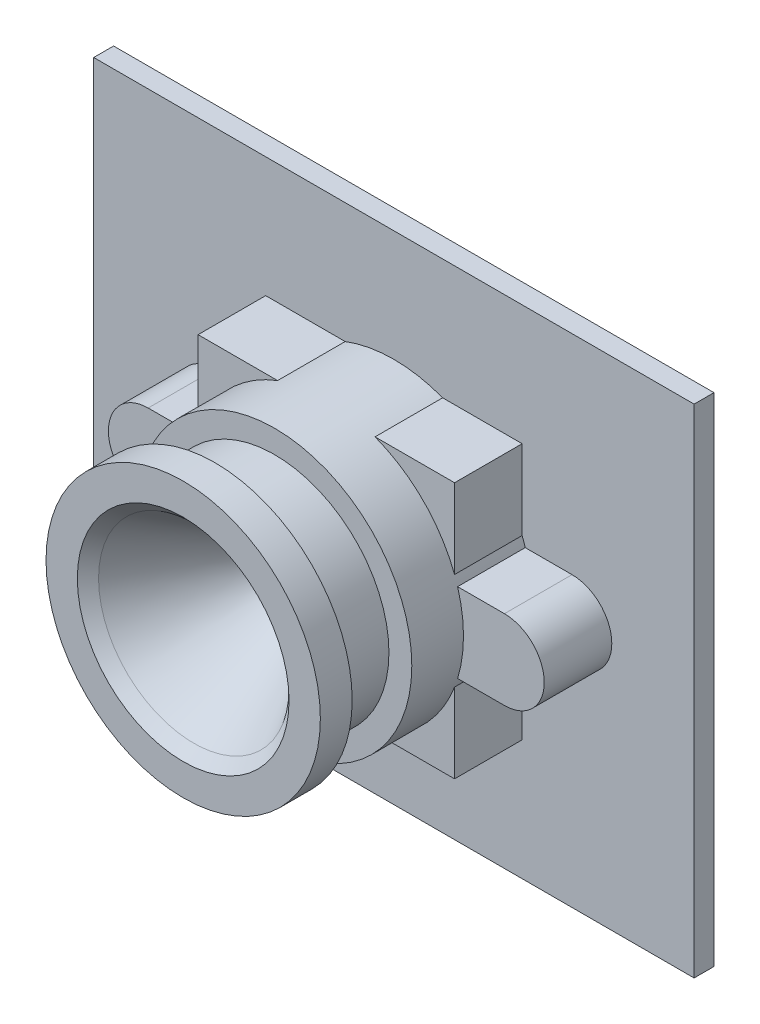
from build123d import *

# Parameters (mm, degrees)
SKETCH1_W           = 30.2
SKETCH1_H           = 25
BOSS_EXTRUDE1_DEPTH = 1
SKETCH2_W           = 12.9
SKETCH2_H           = 12.9
BOSS_EXTRUDE2_DEPTH = 3.4
SKETCH3_R           = 6.9
BOSS_EXTRUDE3_DEPTH = 6
SKETCH4_R           = 5.75
BOSS_EXTRUDE4_DEPTH = 3
SKETCH5_R           = 6.9
BOSS_EXTRUDE5_DEPTH = 1.6
SKETCH6_R           = 5.125
CUT_EXTRUDE1_DEPTH  = 5.65
CUT_EXTRUDE1_DRAFT  = -32
CHAMFER1_SIZE       = 0.2
CHAMFER1_SIZE2      = 0.628676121
SKETCH7_W           = 7.3
SKETCH7_H           = 4.4
BOSS_EXTRUDE6_DEPTH = 3.25
SKETCH8_W           = 6.5
SKETCH8_H           = 2.45
CUT_EXTRUDE2_DEPTH  = 4
BOSS_EXTRUDE7_DEPTH = 3.4


with BuildPart() as part:
    # Sketch1 → Boss-Extrude1 (new body)
    with BuildSketch(Plane.XY):
        Rectangle(SKETCH1_W, SKETCH1_H)
    extrude(amount=BOSS_EXTRUDE1_DEPTH)

    # Sketch2 → Boss-Extrude2 (add)
    with BuildSketch(Plane.XY.offset(1)):
        Rectangle(SKETCH2_W, SKETCH2_H)
    extrude(amount=BOSS_EXTRUDE2_DEPTH)

    # Sketch3 → Boss-Extrude3 (add)
    with BuildSketch(Plane.XY.offset(1)):
        with Locations(Location((0, 0, 0), (0, 0, 159.193052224))):
            Circle(SKETCH3_R)
    extrude(amount=BOSS_EXTRUDE3_DEPTH)

    # Sketch4 → Boss-Extrude4 (add)
    with BuildSketch(Plane.XY.offset(7)):
        Circle(SKETCH4_R)
    extrude(amount=BOSS_EXTRUDE4_DEPTH)

    # Sketch5 → Boss-Extrude5 (add)
    with BuildSketch(Plane.XY.offset(10)):
        with Locations(Location((0, 0, 0), (0, 0, 159.193052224))):
            Circle(SKETCH5_R)
    extrude(amount=BOSS_EXTRUDE5_DEPTH)


with BuildPart() as cut_extrude1_tool:
    # Sketch6 → Cut-Extrude1 (with draft: the straight prism first)
    with BuildSketch(Plane.XY.offset(11.6)):
        Circle(SKETCH6_R)
    extrude(amount=-CUT_EXTRUDE1_DEPTH)
    # Cut-Extrude1: the draft: its side faces are tilted about the plane it starts from
    cut_extrude1_sides = [cut_extrude1_tool.faces().sort_by_distance(p)[0] for p in [
        (-5.125, 0, 8.775),
    ]]
    draft(cut_extrude1_sides, Plane.XY.offset(11.6), CUT_EXTRUDE1_DRAFT)


with BuildPart() as part_1:
    add(part.part)

    # Cut-Extrude1: cut by cut_extrude1_tool
    add(cut_extrude1_tool.part, mode=Mode.SUBTRACT)

    # Chamfer1
    chamfer1_edges = [part_1.edges().sort_by_distance(p)[0] for p in [
        (-5.125, 0, 11.6),
    ]]
    chamfer1_side = [part_1.faces().sort_by_distance(p)[0] for p in [
        (6.26756645, -2.381694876, 11.6),
    ]]
    chamfer(chamfer1_edges, length=CHAMFER1_SIZE, length2=CHAMFER1_SIZE2, reference=chamfer1_side[0])

    # Sketch9 → Boss-Extrude7 (add)
    with BuildSketch(Plane.XY.offset(4.4)):
        with BuildLine():
            Line((8.96, -2), (-8.96, -2))
            ThreePointArc((-8.96, -2), (-10.96, 0), (-8.96, 2))
            Line((-8.96, 2), (8.96, 2))
            ThreePointArc((8.96, 2), (10.96, 0), (8.96, -2))
        make_face()
    extrude(amount=-BOSS_EXTRUDE7_DEPTH)


with BuildPart() as body_2:
    # Sketch7 → Boss-Extrude6 (new body)
    with BuildSketch(Plane(origin=(0, 0, 0), x_dir=(-1, 0, 0), z_dir=(0, 0, -1))):
        with Locations((5.45, -10.3)):
            Rectangle(SKETCH7_W, SKETCH7_H)
    extrude(amount=BOSS_EXTRUDE6_DEPTH)

    # Sketch8 → Cut-Extrude2 (cut)
    with BuildSketch(Plane.XZ.offset(12.5)):
        with Locations((-5.45, -1.625)):
            Rectangle(SKETCH8_W, SKETCH8_H)
    extrude(amount=-CUT_EXTRUDE2_DEPTH, mode=Mode.SUBTRACT)


solid = Compound([part_1.part, body_2.part])
